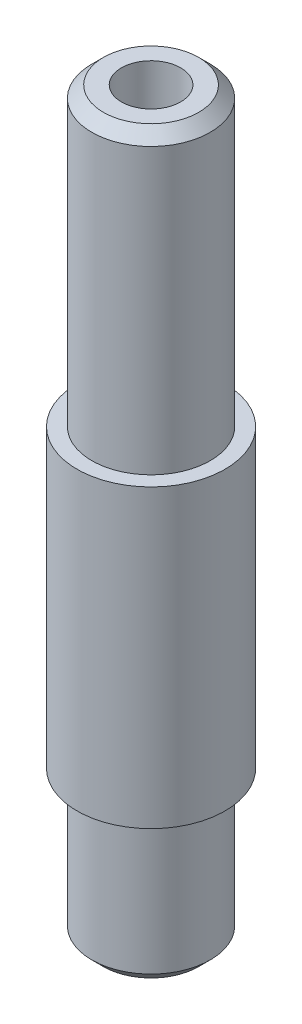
ISO-10303-21;
HEADER;
FILE_DESCRIPTION(('STEP AP214'),'2;1');
FILE_NAME('part.step','',(''),(''),'','','');
FILE_SCHEMA(('AUTOMOTIVE_DESIGN { 1 0 10303 214 1 1 1 1 }'));
ENDSEC;
DATA;
#1=APPLICATION_CONTEXT('core data for automotive mechanical design processes');
#2=APPLICATION_PROTOCOL_DEFINITION('international standard','automotive_design',2000,#1);
#3=PRODUCT_CONTEXT('',#1,'mechanical');
#4=PRODUCT('Part','Part','',(#3));
#5=PRODUCT_RELATED_PRODUCT_CATEGORY('part','',(#4));
#6=PRODUCT_DEFINITION_FORMATION('','',#4);
#7=PRODUCT_DEFINITION_CONTEXT('part definition',#1,'design');
#8=PRODUCT_DEFINITION('design','',#6,#7);
#9=PRODUCT_DEFINITION_SHAPE('','',#8);
#10=(LENGTH_UNIT() NAMED_UNIT(*) SI_UNIT(.MILLI.,.METRE.));
#11=(NAMED_UNIT(*) PLANE_ANGLE_UNIT() SI_UNIT($,.RADIAN.));
#12=(NAMED_UNIT(*) SI_UNIT($,.STERADIAN.) SOLID_ANGLE_UNIT());
#13=UNCERTAINTY_MEASURE_WITH_UNIT(LENGTH_MEASURE(1.E-05),#10,'distance_accuracy_value','');
#14=(GEOMETRIC_REPRESENTATION_CONTEXT(3) GLOBAL_UNCERTAINTY_ASSIGNED_CONTEXT((#13)) GLOBAL_UNIT_ASSIGNED_CONTEXT((#10,
#11,#12)) REPRESENTATION_CONTEXT('',''));
#15=CARTESIAN_POINT('',(0.,0.,0.));
#16=DIRECTION('',(0.,0.,1.));
#17=DIRECTION('',(1.,0.,0.));
#18=AXIS2_PLACEMENT_3D('',#15,#16,#17);
#19=CARTESIAN_POINT('',(0.,25.,0.));
#20=DIRECTION('',(0.,-1.,0.));
#21=DIRECTION('',(0.,0.,-1.));
#22=AXIS2_PLACEMENT_3D('',#19,#20,#21);
#23=CYLINDRICAL_SURFACE('',#22,2.5);
#24=CARTESIAN_POINT('',(0.,5.,0.));
#25=DIRECTION('',(0.,-1.,0.));
#26=DIRECTION('',(0.,0.,-1.));
#27=AXIS2_PLACEMENT_3D('',#24,#25,#26);
#28=CIRCLE('',#27,2.5);
#29=CARTESIAN_POINT('',(0.,5.,-2.5));
#30=VERTEX_POINT('',#29);
#31=EDGE_CURVE('E18',#30,#30,#28,.F.);
#32=ORIENTED_EDGE('',*,*,#31,.T.);
#33=EDGE_LOOP('',(#32));
#34=FACE_BOUND('',#33,.T.);
#35=CARTESIAN_POINT('',(0.,15.,0.));
#36=DIRECTION('',(0.,-1.,0.));
#37=DIRECTION('',(0.,0.,-1.));
#38=AXIS2_PLACEMENT_3D('',#35,#36,#37);
#39=CIRCLE('',#38,2.5);
#40=CARTESIAN_POINT('',(0.,15.,-2.5));
#41=VERTEX_POINT('',#40);
#42=EDGE_CURVE('E44',#41,#41,#39,.T.);
#43=ORIENTED_EDGE('',*,*,#42,.T.);
#44=EDGE_LOOP('',(#43));
#45=FACE_BOUND('',#44,.T.);
#46=ADVANCED_FACE('F15',(#34,#45),#23,.T.);
#47=CARTESIAN_POINT('',(2.,5.,0.));
#48=DIRECTION('',(0.,1.,0.));
#49=DIRECTION('',(0.,0.,1.));
#50=AXIS2_PLACEMENT_3D('',#47,#48,#49);
#51=PLANE('',#50);
#52=CARTESIAN_POINT('',(0.,5.,0.));
#53=DIRECTION('',(0.,1.,0.));
#54=DIRECTION('',(0.,0.,1.));
#55=AXIS2_PLACEMENT_3D('',#52,#53,#54);
#56=CIRCLE('',#55,2.);
#57=CARTESIAN_POINT('',(0.,5.,2.));
#58=VERTEX_POINT('',#57);
#59=EDGE_CURVE('E42',#58,#58,#56,.F.);
#60=ORIENTED_EDGE('',*,*,#59,.F.);
#61=EDGE_LOOP('',(#60));
#62=FACE_BOUND('',#61,.T.);
#63=ORIENTED_EDGE('',*,*,#31,.F.);
#64=EDGE_LOOP('',(#63));
#65=FACE_BOUND('',#64,.T.);
#66=ADVANCED_FACE('F52',(#62,#65),#51,.F.);
#67=CARTESIAN_POINT('',(2.,15.,0.));
#68=DIRECTION('',(0.,-1.,0.));
#69=DIRECTION('',(0.,0.,-1.));
#70=AXIS2_PLACEMENT_3D('',#67,#68,#69);
#71=PLANE('',#70);
#72=CARTESIAN_POINT('',(0.,15.,0.));
#73=DIRECTION('',(0.,-1.,0.));
#74=DIRECTION('',(0.,0.,-1.));
#75=AXIS2_PLACEMENT_3D('',#72,#73,#74);
#76=CIRCLE('',#75,2.);
#77=CARTESIAN_POINT('',(0.,15.,-2.));
#78=VERTEX_POINT('',#77);
#79=EDGE_CURVE('E39',#78,#78,#76,.F.);
#80=ORIENTED_EDGE('',*,*,#79,.F.);
#81=EDGE_LOOP('',(#80));
#82=FACE_BOUND('',#81,.T.);
#83=ORIENTED_EDGE('',*,*,#42,.F.);
#84=EDGE_LOOP('',(#83));
#85=FACE_BOUND('',#84,.T.);
#86=ADVANCED_FACE('F54',(#82,#85),#71,.F.);
#87=CARTESIAN_POINT('',(0.,0.,0.));
#88=DIRECTION('',(0.,1.,0.));
#89=DIRECTION('',(0.,0.,1.));
#90=AXIS2_PLACEMENT_3D('',#87,#88,#89);
#91=CYLINDRICAL_SURFACE('',#90,2.);
#92=ORIENTED_EDGE('',*,*,#59,.T.);
#93=EDGE_LOOP('',(#92));
#94=FACE_BOUND('',#93,.T.);
#95=CARTESIAN_POINT('',(0.,0.390000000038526,0.));
#96=DIRECTION('',(0.,1.,0.));
#97=DIRECTION('',(0.,0.,1.));
#98=AXIS2_PLACEMENT_3D('',#95,#96,#97);
#99=CIRCLE('',#98,2.00000000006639);
#100=CARTESIAN_POINT('',(0.,0.390000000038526,2.00000000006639));
#101=VERTEX_POINT('',#100);
#102=EDGE_CURVE('E30',#101,#101,#99,.F.);
#103=ORIENTED_EDGE('',*,*,#102,.F.);
#104=EDGE_LOOP('',(#103));
#105=FACE_BOUND('',#104,.T.);
#106=ADVANCED_FACE('F61',(#94,#105),#91,.T.);
#107=CARTESIAN_POINT('',(0.,25.,0.));
#108=DIRECTION('',(0.,-1.,0.));
#109=DIRECTION('',(0.,0.,-1.));
#110=AXIS2_PLACEMENT_3D('',#107,#108,#109);
#111=CYLINDRICAL_SURFACE('',#110,2.);
#112=CARTESIAN_POINT('',(0.,24.6100000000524,0.));
#113=DIRECTION('',(0.,-1.,0.));
#114=DIRECTION('',(0.,0.,-1.));
#115=AXIS2_PLACEMENT_3D('',#112,#113,#114);
#116=CIRCLE('',#115,2.00000000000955);
#117=CARTESIAN_POINT('',(0.,24.6100000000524,-2.00000000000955));
#118=VERTEX_POINT('',#117);
#119=EDGE_CURVE('E38',#118,#118,#116,.F.);
#120=ORIENTED_EDGE('',*,*,#119,.F.);
#121=EDGE_LOOP('',(#120));
#122=FACE_BOUND('',#121,.T.);
#123=ORIENTED_EDGE('',*,*,#79,.T.);
#124=EDGE_LOOP('',(#123));
#125=FACE_BOUND('',#124,.T.);
#126=ADVANCED_FACE('F89',(#122,#125),#111,.T.);
#127=CARTESIAN_POINT('',(0.,0.390000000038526,0.));
#128=DIRECTION('',(0.,1.,0.));
#129=DIRECTION('',(0.,0.,1.));
#130=AXIS2_PLACEMENT_3D('',#127,#128,#129);
#131=CONICAL_SURFACE('',#130,2.00000000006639,0.785398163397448);
#132=ORIENTED_EDGE('',*,*,#102,.T.);
#133=EDGE_LOOP('',(#132));
#134=FACE_BOUND('',#133,.T.);
#135=CARTESIAN_POINT('',(0.,0.,0.));
#136=DIRECTION('',(0.,1.,0.));
#137=DIRECTION('',(0.,0.,1.));
#138=AXIS2_PLACEMENT_3D('',#135,#136,#137);
#139=CIRCLE('',#138,1.61000000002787);
#140=CARTESIAN_POINT('',(0.,0.,1.61000000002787));
#141=VERTEX_POINT('',#140);
#142=EDGE_CURVE('E35',#141,#141,#139,.T.);
#143=ORIENTED_EDGE('',*,*,#142,.T.);
#144=EDGE_LOOP('',(#143));
#145=FACE_BOUND('',#144,.T.);
#146=ADVANCED_FACE('F85',(#134,#145),#131,.T.);
#147=CARTESIAN_POINT('',(0.,24.6100000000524,0.));
#148=DIRECTION('',(0.,-1.,0.));
#149=DIRECTION('',(0.,0.,-1.));
#150=AXIS2_PLACEMENT_3D('',#147,#148,#149);
#151=CONICAL_SURFACE('',#150,2.00000000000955,0.785398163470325);
#152=CARTESIAN_POINT('',(0.,24.9999999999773,0.));
#153=DIRECTION('',(0.,-1.,0.));
#154=DIRECTION('',(0.,0.,-1.));
#155=AXIS2_PLACEMENT_3D('',#152,#153,#154);
#156=CIRCLE('',#155,1.61000000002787);
#157=CARTESIAN_POINT('',(0.,24.9999999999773,-1.61000000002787));
#158=VERTEX_POINT('',#157);
#159=EDGE_CURVE('E27',#158,#158,#156,.F.);
#160=ORIENTED_EDGE('',*,*,#159,.F.);
#161=EDGE_LOOP('',(#160));
#162=FACE_BOUND('',#161,.T.);
#163=ORIENTED_EDGE('',*,*,#119,.T.);
#164=EDGE_LOOP('',(#163));
#165=FACE_BOUND('',#164,.T.);
#166=ADVANCED_FACE('F81',(#162,#165),#151,.T.);
#167=CARTESIAN_POINT('',(0.,0.,0.));
#168=DIRECTION('',(0.,1.,0.));
#169=DIRECTION('',(0.,0.,1.));
#170=AXIS2_PLACEMENT_3D('',#167,#168,#169);
#171=PLANE('',#170);
#172=ORIENTED_EDGE('',*,*,#142,.F.);
#173=EDGE_LOOP('',(#172));
#174=FACE_BOUND('',#173,.T.);
#175=CARTESIAN_POINT('',(0.,0.,0.));
#176=DIRECTION('',(0.,-1.,0.));
#177=DIRECTION('',(0.,0.,-1.));
#178=AXIS2_PLACEMENT_3D('',#175,#176,#177);
#179=CIRCLE('',#178,1.);
#180=CARTESIAN_POINT('',(0.,0.,-1.));
#181=VERTEX_POINT('',#180);
#182=EDGE_CURVE('E22',#181,#181,#179,.F.);
#183=ORIENTED_EDGE('',*,*,#182,.T.);
#184=EDGE_LOOP('',(#183));
#185=FACE_BOUND('',#184,.T.);
#186=ADVANCED_FACE('F73',(#174,#185),#171,.F.);
#187=CARTESIAN_POINT('',(0.,25.,0.));
#188=DIRECTION('',(0.,1.,0.));
#189=DIRECTION('',(0.,0.,1.));
#190=AXIS2_PLACEMENT_3D('',#187,#188,#189);
#191=PLANE('',#190);
#192=ORIENTED_EDGE('',*,*,#159,.T.);
#193=EDGE_LOOP('',(#192));
#194=FACE_BOUND('',#193,.T.);
#195=CARTESIAN_POINT('',(0.,25.,0.));
#196=DIRECTION('',(0.,-1.,0.));
#197=DIRECTION('',(0.,0.,-1.));
#198=AXIS2_PLACEMENT_3D('',#195,#196,#197);
#199=CIRCLE('',#198,1.);
#200=CARTESIAN_POINT('',(0.,25.,-1.));
#201=VERTEX_POINT('',#200);
#202=EDGE_CURVE('E10',#201,#201,#199,.T.);
#203=ORIENTED_EDGE('',*,*,#202,.T.);
#204=EDGE_LOOP('',(#203));
#205=FACE_BOUND('',#204,.T.);
#206=ADVANCED_FACE('F67',(#194,#205),#191,.T.);
#207=CARTESIAN_POINT('',(0.,25.,0.));
#208=DIRECTION('',(0.,-1.,0.));
#209=DIRECTION('',(0.,0.,-1.));
#210=AXIS2_PLACEMENT_3D('',#207,#208,#209);
#211=CYLINDRICAL_SURFACE('',#210,1.);
#212=ORIENTED_EDGE('',*,*,#182,.F.);
#213=EDGE_LOOP('',(#212));
#214=FACE_BOUND('',#213,.T.);
#215=ORIENTED_EDGE('',*,*,#202,.F.);
#216=EDGE_LOOP('',(#215));
#217=FACE_BOUND('',#216,.T.);
#218=ADVANCED_FACE('F65',(#214,#217),#211,.F.);
#219=CLOSED_SHELL('',(#46,#66,#86,#106,#126,#146,#166,#186,#206,#218));
#220=MANIFOLD_SOLID_BREP('B1',#219);
#221=ADVANCED_BREP_SHAPE_REPRESENTATION('',(#18,#220),#14);
#222=SHAPE_DEFINITION_REPRESENTATION(#9,#221);
ENDSEC;
END-ISO-10303-21;
